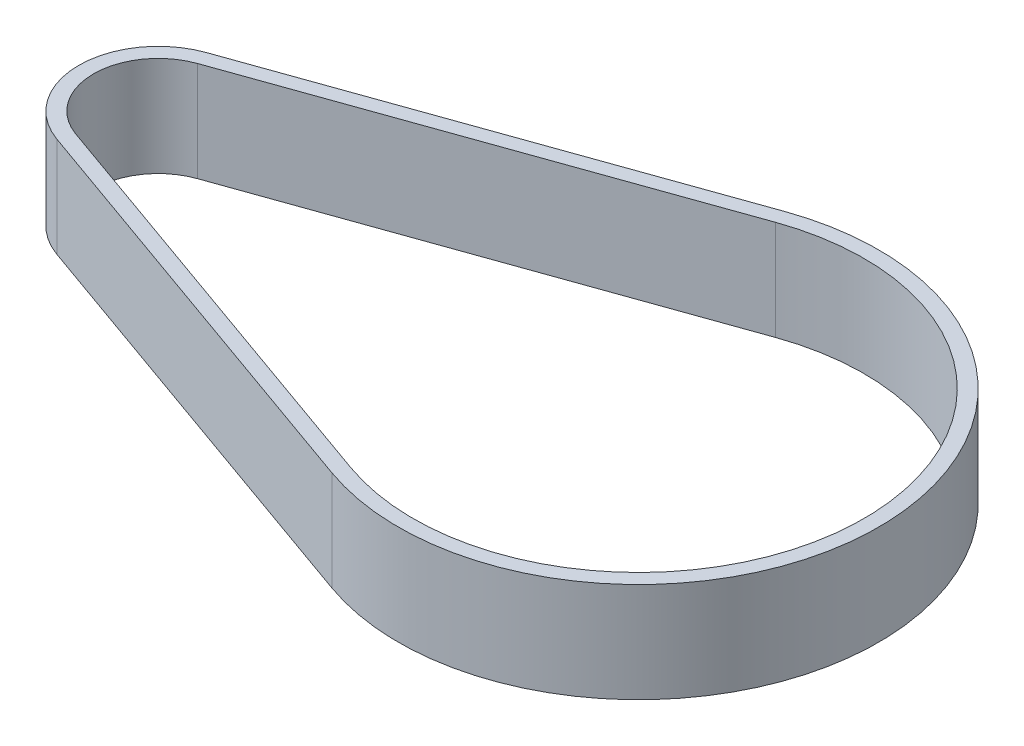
from build123d import *

# Parameters (mm, degrees)
EXTRU_MINCE1_DEPTH = 27


with BuildPart() as part:
    # Esquisse2 → Extru.-Mince1 (new body)
    with BuildSketch(Plane(origin=(0, -1.75, 0), x_dir=(-1, 0, 0), z_dir=(0, 1, 0))):
        with BuildLine():
            Line((137.19463009, -20.260486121), (21.752015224, -61.254907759))
            ThreePointArc((21.752015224, -61.254907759), (-65.0024145, 0), (21.752015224, 61.254907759))
            Line((21.752015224, 61.254907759), (137.19463009, 20.260486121))
            ThreePointArc((137.19463009, 20.260486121), (151.5, 0), (137.19463009, -20.260486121))
        make_face()
        with BuildLine():
            Line((135.85609426, -16.491093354), (20.413479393, -57.485514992))
            ThreePointArc((20.413479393, -57.485514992), (-61.0024145, 0), (20.413479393, 57.485514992))
            Line((20.413479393, 57.485514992), (135.85609426, 16.491093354))
            ThreePointArc((135.85609426, 16.491093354), (147.5, 0), (135.85609426, -16.491093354))
        make_face(mode=Mode.SUBTRACT)
    extrude(amount=-EXTRU_MINCE1_DEPTH)


solid = part.part
